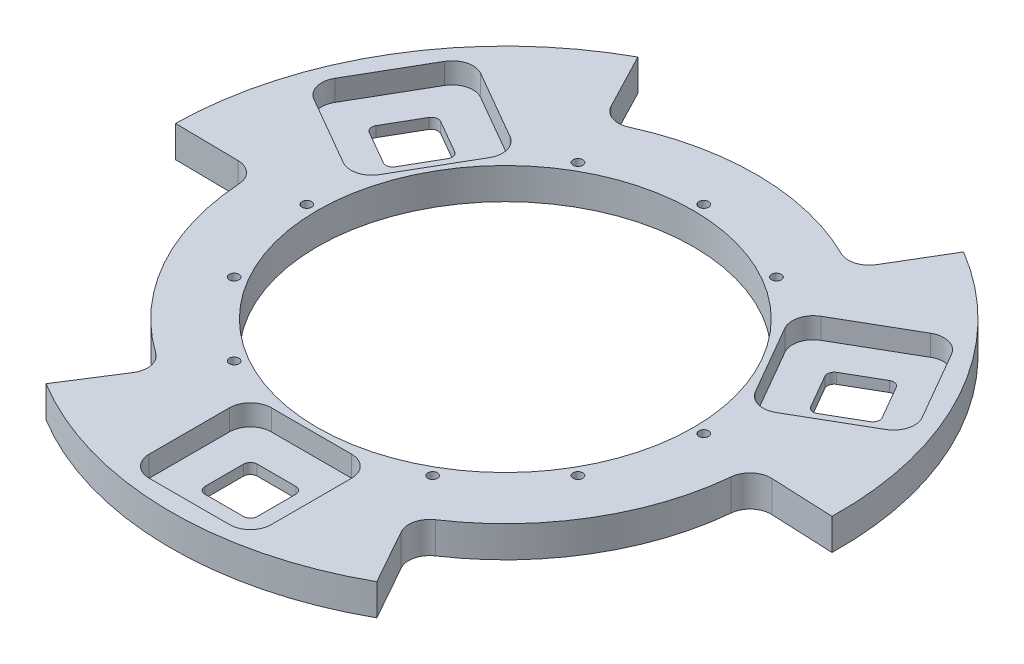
from build123d import *

# Parameters (mm, degrees)
SKETCH1_R           = 101.6
SKETCH1_R_2         = 57.15
BOSS_EXTRUDE1_DEPTH = 9.525
CUT_EXTRUDE3_DEPTH  = 6.35
CUT_EXTRUDE4_DEPTH  = 144.999463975
CUT_EXTRUDE5_DEPTH  = 144.999463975
SKETCH7_R           = 1.4732
CUT_EXTRUDE6_DEPTH  = 144.999463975
SKETCH8_R           = 2.778125
CUT_EXTRUDE7_DEPTH  = 3.3528


with BuildPart() as part:
    # Sketch1 → Boss-Extrude1 (new body)
    with BuildSketch(Plane(origin=(0, 0, 0), x_dir=(1, 0, 0), z_dir=(0, 1, 0))):
        with Locations(Location((0, 0, 0), (0, 0, 90))):
            Circle(SKETCH1_R)
        with Locations(Location((0, 0, 0), (0, 0, 90))):
            Circle(SKETCH1_R_2, mode=Mode.SUBTRACT)
    extrude(amount=BOSS_EXTRUDE1_DEPTH)

    # Sketch4 → Cut-Extrude3 (cut)
    with BuildSketch(Plane(origin=(0, 9.525, 0), x_dir=(1, 0, 0), z_dir=(0, 1, 0))):
        with BuildLine():
            Line((-89.262179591, 37.442769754), (-77.057479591, 58.581930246))
            ThreePointArc((-77.057479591, 58.581930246), (-73.201719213, 61.540559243), (-68.383218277, 60.90619156))
            Line((-68.383218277, 60.90619156), (-47.244057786, 48.70149156))
            ThreePointArc((-47.244057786, 48.70149156), (-44.285428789, 44.845731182), (-44.919796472, 40.027230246))
            Line((-44.919796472, 40.027230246), (-57.124496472, 18.888069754))
            ThreePointArc((-57.124496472, 18.888069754), (-60.980256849, 15.929440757), (-65.798757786, 16.56380844))
            Line((-65.798757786, 16.56380844), (-86.937918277, 28.76850844))
            ThreePointArc((-86.937918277, 28.76850844), (-89.896547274, 32.624268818), (-89.262179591, 37.442769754))
        make_face()
        with BuildLine():
            Line((12.2047, -96.0247), (-12.2047, -96.0247))
            ThreePointArc((-12.2047, -96.0247), (-16.694828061, -94.164828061), (-18.5547, -89.6747))
            Line((-18.5547, -89.6747), (-18.5547, -65.2653))
            ThreePointArc((-18.5547, -65.2653), (-16.694828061, -60.775171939), (-12.2047, -58.9153))
            Line((-12.2047, -58.9153), (12.2047, -58.9153))
            ThreePointArc((12.2047, -58.9153), (16.694828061, -60.775171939), (18.5547, -65.2653))
            Line((18.5547, -65.2653), (18.5547, -89.6747))
            ThreePointArc((18.5547, -89.6747), (16.694828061, -94.164828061), (12.2047, -96.0247))
        make_face()
        with BuildLine():
            Line((77.057479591, 58.581930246), (89.262179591, 37.442769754))
            ThreePointArc((89.262179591, 37.442769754), (89.896547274, 32.624268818), (86.937918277, 28.76850844))
            Line((86.937918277, 28.76850844), (65.798757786, 16.56380844))
            ThreePointArc((65.798757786, 16.56380844), (60.980256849, 15.929440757), (57.124496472, 18.888069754))
            Line((57.124496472, 18.888069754), (44.919796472, 40.027230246))
            ThreePointArc((44.919796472, 40.027230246), (44.285428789, 44.845731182), (47.244057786, 48.70149156))
            Line((47.244057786, 48.70149156), (68.383218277, 60.90619156))
            ThreePointArc((68.383218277, 60.90619156), (73.201719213, 61.540559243), (77.057479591, 58.581930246))
        make_face()
    extrude(amount=-CUT_EXTRUDE3_DEPTH, mode=Mode.SUBTRACT)

    # Sketch5 → Cut-Extrude4 (cut, through all)
    with BuildSketch(Plane(origin=(0, 9.525, 0), x_dir=(1, 0, 0), z_dir=(0, 1, 0))):
        with BuildLine():
            Line((-76.892414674, 37.633431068), (-71.037714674, 47.774068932))
            ThreePointArc((-71.037714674, 47.774068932), (-69.77302527, 48.744499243), (-68.192556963, 48.536426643))
            Line((-68.192556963, 48.536426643), (-58.0519191, 42.681726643))
            ThreePointArc((-58.0519191, 42.681726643), (-57.081488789, 41.417037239), (-57.289561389, 39.836568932))
            Line((-57.289561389, 39.836568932), (-63.144261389, 29.695931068))
            ThreePointArc((-63.144261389, 29.695931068), (-64.408950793, 28.725500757), (-65.9894191, 28.933573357))
            Line((-65.9894191, 28.933573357), (-76.130056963, 34.788273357))
            ThreePointArc((-76.130056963, 34.788273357), (-77.100487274, 36.052962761), (-76.892414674, 37.633431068))
        make_face()
        with BuildLine():
            Line((5.8547, -85.4075), (-5.8547, -85.4075))
            ThreePointArc((-5.8547, -85.4075), (-7.327462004, -84.797462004), (-7.9375, -83.3247))
            Line((-7.9375, -83.3247), (-7.9375, -71.6153))
            ThreePointArc((-7.9375, -71.6153), (-7.327462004, -70.142537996), (-5.8547, -69.5325))
            Line((-5.8547, -69.5325), (5.8547, -69.5325))
            ThreePointArc((5.8547, -69.5325), (7.327462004, -70.142537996), (7.9375, -71.6153))
            Line((7.9375, -71.6153), (7.9375, -83.3247))
            ThreePointArc((7.9375, -83.3247), (7.327462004, -84.797462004), (5.8547, -85.4075))
        make_face()
        with BuildLine():
            Line((71.037714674, 47.774068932), (76.892414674, 37.633431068))
            ThreePointArc((76.892414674, 37.633431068), (77.100487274, 36.052962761), (76.130056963, 34.788273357))
            Line((76.130056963, 34.788273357), (65.9894191, 28.933573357))
            ThreePointArc((65.9894191, 28.933573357), (64.408950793, 28.725500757), (63.144261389, 29.695931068))
            Line((63.144261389, 29.695931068), (57.289561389, 39.836568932))
            ThreePointArc((57.289561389, 39.836568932), (57.081488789, 41.417037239), (58.0519191, 42.681726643))
            Line((58.0519191, 42.681726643), (68.192556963, 48.536426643))
            ThreePointArc((68.192556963, 48.536426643), (69.77302527, 48.744499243), (71.037714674, 47.774068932))
        make_face()
    extrude(amount=-CUT_EXTRUDE4_DEPTH, mode=Mode.SUBTRACT)

    # Sketch6 → Cut-Extrude5 (cut, through all)
    with BuildSketch(Plane(origin=(0, 9.525, 0), x_dir=(1, 0, 0), z_dir=(0, 1, 0))):
        with BuildLine():
            Line((49.616347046, -88.661029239), (40.193834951, -71.823642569))
            ThreePointArc((40.193834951, -71.823642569), (39.562206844, -67.233566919), (42.217060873, -63.436265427))
            ThreePointArc((42.217060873, -63.436265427), (65.392573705, -39.118426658), (75.859264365, -7.198055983))
            ThreePointArc((75.859264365, -7.198055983), (78.011761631, -3.008213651), (82.458369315, -1.453960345))
            Line((82.458369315, -1.453960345), (101.574186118, -2.29013417))
            ThreePointArc((101.574186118, -2.29013417), (87.061054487, -52.373015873), (49.616347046, -88.661029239))
        make_face()
        with BuildLine():
            Line((-101.59087717, 1.361497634), (-82.298016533, 1.102939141))
            ThreePointArc((-82.298016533, 1.102939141), (-78.007080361, -0.645092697), (-76.045947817, -4.842914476))
            ThreePointArc((-76.045947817, -4.842914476), (-66.573838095, -37.072416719), (-44.163331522, -62.097022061))
            ThreePointArc((-44.163331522, -62.097022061), (-41.611070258, -66.056060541), (-42.488351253, -70.684062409))
            Line((-42.488351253, -70.684062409), (-52.770407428, -86.820758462))
            ThreePointArc((-52.770407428, -86.820758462), (-88.886889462, -49.21057693), (-101.59087717, 1.361497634))
        make_face()
        with BuildLine():
            Line((51.974530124, 87.299531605), (42.104181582, 70.720703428))
            ThreePointArc((42.104181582, 70.720703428), (38.444873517, 67.878659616), (33.828886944, 68.279179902))
            ThreePointArc((33.828886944, 68.279179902), (1.181264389, 76.190843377), (-31.695932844, 69.295078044))
            ThreePointArc((-31.695932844, 69.295078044), (-36.400691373, 69.064274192), (-39.970018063, 72.138022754))
            Line((-39.970018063, 72.138022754), (-48.80377869, 89.110892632))
            ThreePointArc((-48.80377869, 89.110892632), (1.825834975, 101.583592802), (51.974530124, 87.299531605))
        make_face()
    extrude(amount=-CUT_EXTRUDE5_DEPTH, mode=Mode.SUBTRACT)

    # Sketch7 → Cut-Extrude6 (cut, through all)
    with BuildSketch(Plane(origin=(0, 9.525, 0), x_dir=(1, 0, 0), z_dir=(0, 1, 0))):
        with Locations(Location((0, 60.325, 0), (0, 0, 270))):
            Circle(SKETCH7_R)
        with Locations(Location((30.1625, 52.242982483, 0), (0, 0, 270))):
            Circle(SKETCH7_R)
        with Locations(Location((-30.1625, 52.242982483, 0), (0, 0, 270))):
            Circle(SKETCH7_R)
        with Locations(Location((30.1625, -52.242982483, 0), (0, 0, 270))):
            Circle(SKETCH7_R)
        with Locations(Location((52.242982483, -30.1625, 0), (0, 0, 270))):
            Circle(SKETCH7_R)
        with Locations(Location((60.325, 0, 0), (0, 0, 270))):
            Circle(SKETCH7_R)
        with Locations(Location((-60.325, 0, 0), (0, 0, 270))):
            Circle(SKETCH7_R)
        with Locations(Location((-52.242982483, -30.1625, 0), (0, 0, 270))):
            Circle(SKETCH7_R)
        with Locations(Location((-30.1625, -52.242982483, 0), (0, 0, 270))):
            Circle(SKETCH7_R)
    extrude(amount=-CUT_EXTRUDE6_DEPTH, mode=Mode.SUBTRACT)

    # Sketch8 → Cut-Extrude7 (cut)
    with BuildSketch(Plane.XZ):
        with Locations(Location((-30.1625, -52.242982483, 0), (0, 0, 270))):
            Circle(SKETCH8_R)
        with Locations(Location((0, -60.325, 0), (0, 0, 270))):
            Circle(SKETCH8_R)
        with Locations(Location((30.1625, -52.242982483, 0), (0, 0, 270))):
            Circle(SKETCH8_R)
        with Locations(Location((-30.1625, 52.242982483, 0), (0, 0, 270))):
            Circle(SKETCH8_R)
        with Locations(Location((-52.242982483, 30.1625, 0), (0, 0, 270))):
            Circle(SKETCH8_R)
        with Locations(Location((-60.325, 0, 0), (0, 0, 270))):
            Circle(SKETCH8_R)
        with Locations(Location((60.325, 0, 0), (0, 0, 270))):
            Circle(SKETCH8_R)
        with Locations(Location((52.242982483, 30.1625, 0), (0, 0, 270))):
            Circle(SKETCH8_R)
        with Locations(Location((30.1625, 52.242982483, 0), (0, 0, 270))):
            Circle(SKETCH8_R)
    extrude(amount=-CUT_EXTRUDE7_DEPTH, mode=Mode.SUBTRACT)


solid = part.part
